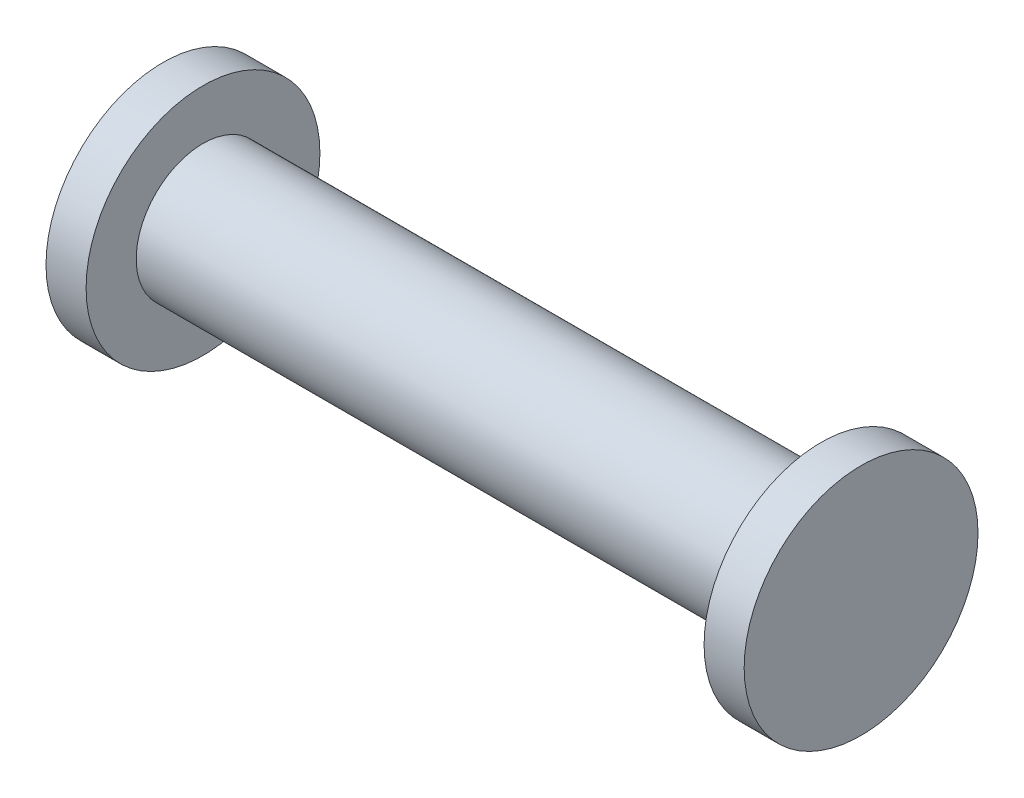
from build123d import *

# Parameters (mm, degrees)
SKETCH_1_R           = 2
F_01_SHAFT_D4_DEPTH  = 9.25
SKETCH_2_R           = 3.5
F_02_HEAD_D7_R_DEPTH = 1.2
F_02_HEAD_D7_L_START = -1.2
SKETCH_3_R           = 3.5
F_02_HEAD_D7_L_DEPTH = 1.2


with BuildPart() as part:
    # Sketch 1 → 01_SHAFT_D4 (new, symmetric)
    with BuildSketch(Plane(origin=(0, 0, 0), x_dir=(0, 0, -1), z_dir=(1, 0, 0))):
        Circle(SKETCH_1_R)
    extrude(amount=F_01_SHAFT_D4_DEPTH, both=True)

    # Sketch 2 → 02_HEAD_D7_R (add)
    with BuildSketch(Plane(origin=(9.25, 0, 0), x_dir=(0, 0, -1), z_dir=(1, 0, 0))):
        Circle(SKETCH_2_R)
    extrude(amount=F_02_HEAD_D7_R_DEPTH)

    # Sketch 3 → 02_HEAD_D7_L (add)
    with BuildSketch(Plane(origin=(-9.25, 0, 0), x_dir=(0, 0, -1), z_dir=(1, 0, 0)).offset(F_02_HEAD_D7_L_START)):
        Circle(SKETCH_3_R)
    extrude(amount=F_02_HEAD_D7_L_DEPTH)


solid = part.part
